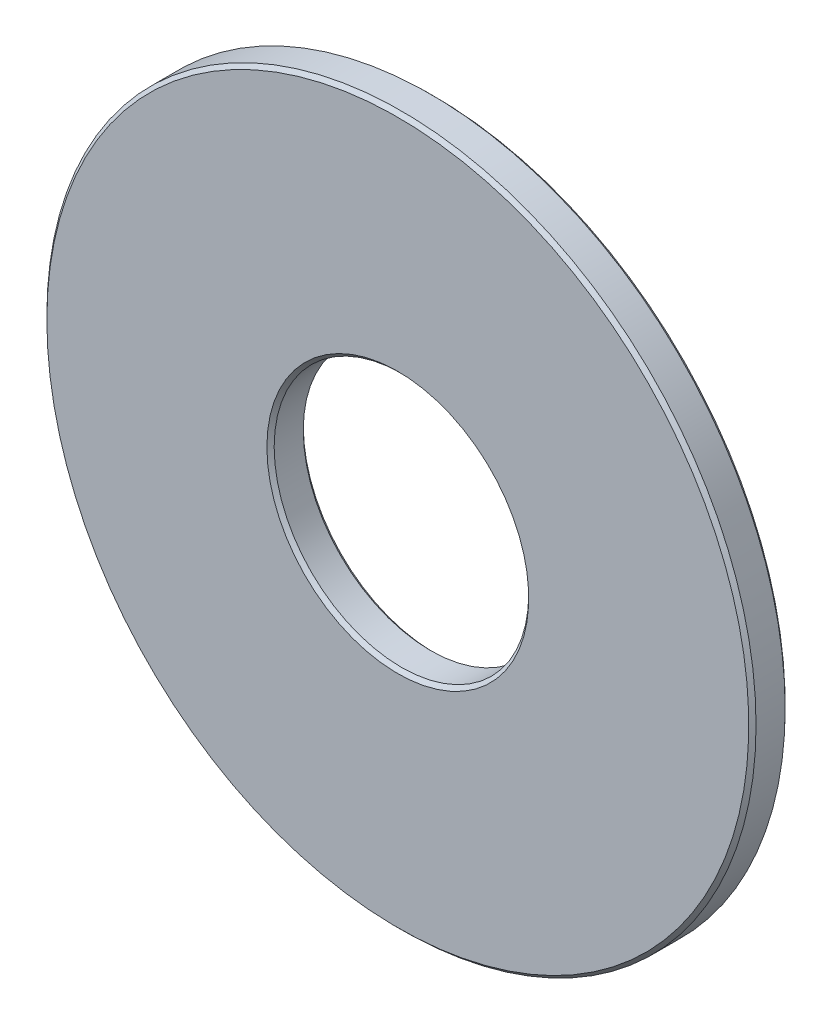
ISO-10303-21;
HEADER;
FILE_DESCRIPTION(('STEP AP214'),'2;1');
FILE_NAME('part.step','',(''),(''),'','','');
FILE_SCHEMA(('AUTOMOTIVE_DESIGN { 1 0 10303 214 1 1 1 1 }'));
ENDSEC;
DATA;
#1=APPLICATION_CONTEXT('core data for automotive mechanical design processes');
#2=APPLICATION_PROTOCOL_DEFINITION('international standard','automotive_design',2000,#1);
#3=PRODUCT_CONTEXT('',#1,'mechanical');
#4=PRODUCT('Part','Part','',(#3));
#5=PRODUCT_RELATED_PRODUCT_CATEGORY('part','',(#4));
#6=PRODUCT_DEFINITION_FORMATION('','',#4);
#7=PRODUCT_DEFINITION_CONTEXT('part definition',#1,'design');
#8=PRODUCT_DEFINITION('design','',#6,#7);
#9=PRODUCT_DEFINITION_SHAPE('','',#8);
#10=(LENGTH_UNIT() NAMED_UNIT(*) SI_UNIT(.MILLI.,.METRE.));
#11=(NAMED_UNIT(*) PLANE_ANGLE_UNIT() SI_UNIT($,.RADIAN.));
#12=(NAMED_UNIT(*) SI_UNIT($,.STERADIAN.) SOLID_ANGLE_UNIT());
#13=UNCERTAINTY_MEASURE_WITH_UNIT(LENGTH_MEASURE(1.E-05),#10,'distance_accuracy_value','');
#14=(GEOMETRIC_REPRESENTATION_CONTEXT(3) GLOBAL_UNCERTAINTY_ASSIGNED_CONTEXT((#13)) GLOBAL_UNIT_ASSIGNED_CONTEXT((#10,
#11,#12)) REPRESENTATION_CONTEXT('',''));
#15=CARTESIAN_POINT('',(0.,0.,0.));
#16=DIRECTION('',(0.,0.,1.));
#17=DIRECTION('',(1.,0.,0.));
#18=AXIS2_PLACEMENT_3D('',#15,#16,#17);
#19=CARTESIAN_POINT('',(0.,0.,2.));
#20=DIRECTION('',(0.,0.,-1.));
#21=DIRECTION('',(-1.,0.,0.));
#22=AXIS2_PLACEMENT_3D('',#19,#20,#21);
#23=CYLINDRICAL_SURFACE('',#22,7.);
#24=CARTESIAN_POINT('',(0.,0.,0.2));
#25=DIRECTION('',(0.,0.,-1.));
#26=DIRECTION('',(-1.,0.,0.));
#27=AXIS2_PLACEMENT_3D('',#24,#25,#26);
#28=CIRCLE('',#27,7.);
#29=CARTESIAN_POINT('',(-7.,0.,0.2));
#30=VERTEX_POINT('',#29);
#31=EDGE_CURVE('E25',#30,#30,#28,.T.);
#32=ORIENTED_EDGE('',*,*,#31,.T.);
#33=EDGE_LOOP('',(#32));
#34=FACE_BOUND('',#33,.T.);
#35=CARTESIAN_POINT('',(0.,0.,1.8));
#36=DIRECTION('',(0.,0.,-1.));
#37=DIRECTION('',(-1.,0.,0.));
#38=AXIS2_PLACEMENT_3D('',#35,#36,#37);
#39=CIRCLE('',#38,7.);
#40=CARTESIAN_POINT('',(-7.,0.,1.8));
#41=VERTEX_POINT('',#40);
#42=EDGE_CURVE('E29',#41,#41,#39,.F.);
#43=ORIENTED_EDGE('',*,*,#42,.T.);
#44=EDGE_LOOP('',(#43));
#45=FACE_BOUND('',#44,.T.);
#46=ADVANCED_FACE('F14',(#34,#45),#23,.F.);
#47=CARTESIAN_POINT('',(0.,0.,2.));
#48=DIRECTION('',(0.,0.,-1.));
#49=DIRECTION('',(-1.,0.,0.));
#50=AXIS2_PLACEMENT_3D('',#47,#48,#49);
#51=CYLINDRICAL_SURFACE('',#50,19.5);
#52=CARTESIAN_POINT('',(0.,0.,0.2));
#53=DIRECTION('',(0.,0.,-1.));
#54=DIRECTION('',(-1.,0.,0.));
#55=AXIS2_PLACEMENT_3D('',#52,#53,#54);
#56=CIRCLE('',#55,19.5);
#57=CARTESIAN_POINT('',(-19.5,0.,0.2));
#58=VERTEX_POINT('',#57);
#59=EDGE_CURVE('E34',#58,#58,#56,.F.);
#60=ORIENTED_EDGE('',*,*,#59,.T.);
#61=EDGE_LOOP('',(#60));
#62=FACE_BOUND('',#61,.T.);
#63=CARTESIAN_POINT('',(0.,0.,1.8));
#64=DIRECTION('',(0.,0.,-1.));
#65=DIRECTION('',(-1.,0.,0.));
#66=AXIS2_PLACEMENT_3D('',#63,#64,#65);
#67=CIRCLE('',#66,19.5);
#68=CARTESIAN_POINT('',(-19.5,0.,1.8));
#69=VERTEX_POINT('',#68);
#70=EDGE_CURVE('E37',#69,#69,#67,.T.);
#71=ORIENTED_EDGE('',*,*,#70,.T.);
#72=EDGE_LOOP('',(#71));
#73=FACE_BOUND('',#72,.T.);
#74=ADVANCED_FACE('F16',(#62,#73),#51,.T.);
#75=CARTESIAN_POINT('',(0.,0.,2.));
#76=DIRECTION('',(0.,0.,-1.));
#77=DIRECTION('',(-1.,0.,0.));
#78=AXIS2_PLACEMENT_3D('',#75,#76,#77);
#79=PLANE('',#78);
#80=CARTESIAN_POINT('',(0.,0.,2.));
#81=DIRECTION('',(0.,0.,-1.));
#82=DIRECTION('',(-1.,0.,0.));
#83=AXIS2_PLACEMENT_3D('',#80,#81,#82);
#84=CIRCLE('',#83,7.2);
#85=CARTESIAN_POINT('',(-7.2,0.,2.));
#86=VERTEX_POINT('',#85);
#87=EDGE_CURVE('E10',#86,#86,#84,.T.);
#88=ORIENTED_EDGE('',*,*,#87,.T.);
#89=EDGE_LOOP('',(#88));
#90=FACE_BOUND('',#89,.T.);
#91=CARTESIAN_POINT('',(0.,0.,2.));
#92=DIRECTION('',(0.,0.,-1.));
#93=DIRECTION('',(-1.,0.,0.));
#94=AXIS2_PLACEMENT_3D('',#91,#92,#93);
#95=CIRCLE('',#94,19.3);
#96=CARTESIAN_POINT('',(-19.3,0.,2.));
#97=VERTEX_POINT('',#96);
#98=EDGE_CURVE('E21',#97,#97,#95,.F.);
#99=ORIENTED_EDGE('',*,*,#98,.T.);
#100=EDGE_LOOP('',(#99));
#101=FACE_BOUND('',#100,.T.);
#102=ADVANCED_FACE('F77',(#90,#101),#79,.F.);
#103=CARTESIAN_POINT('',(0.,0.,0.));
#104=DIRECTION('',(0.,0.,-1.));
#105=DIRECTION('',(-1.,0.,0.));
#106=AXIS2_PLACEMENT_3D('',#103,#104,#105);
#107=PLANE('',#106);
#108=CARTESIAN_POINT('',(0.,0.,0.));
#109=DIRECTION('',(0.,0.,-1.));
#110=DIRECTION('',(-1.,0.,0.));
#111=AXIS2_PLACEMENT_3D('',#108,#109,#110);
#112=CIRCLE('',#111,19.3);
#113=CARTESIAN_POINT('',(-19.3,0.,0.));
#114=VERTEX_POINT('',#113);
#115=EDGE_CURVE('E40',#114,#114,#112,.T.);
#116=ORIENTED_EDGE('',*,*,#115,.T.);
#117=EDGE_LOOP('',(#116));
#118=FACE_BOUND('',#117,.T.);
#119=CARTESIAN_POINT('',(0.,0.,0.));
#120=DIRECTION('',(0.,0.,-1.));
#121=DIRECTION('',(-1.,0.,0.));
#122=AXIS2_PLACEMENT_3D('',#119,#120,#121);
#123=CIRCLE('',#122,7.2);
#124=CARTESIAN_POINT('',(-7.2,0.,0.));
#125=VERTEX_POINT('',#124);
#126=EDGE_CURVE('E43',#125,#125,#123,.F.);
#127=ORIENTED_EDGE('',*,*,#126,.T.);
#128=EDGE_LOOP('',(#127));
#129=FACE_BOUND('',#128,.T.);
#130=ADVANCED_FACE('F47',(#118,#129),#107,.T.);
#131=CARTESIAN_POINT('',(0.,0.,0.));
#132=DIRECTION('',(0.,0.,1.));
#133=DIRECTION('',(1.,0.,0.));
#134=AXIS2_PLACEMENT_3D('',#131,#132,#133);
#135=CONICAL_SURFACE('',#134,19.3,0.785398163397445);
#136=ORIENTED_EDGE('',*,*,#59,.F.);
#137=EDGE_LOOP('',(#136));
#138=FACE_BOUND('',#137,.T.);
#139=ORIENTED_EDGE('',*,*,#115,.F.);
#140=EDGE_LOOP('',(#139));
#141=FACE_BOUND('',#140,.T.);
#142=ADVANCED_FACE('F53',(#138,#141),#135,.T.);
#143=CARTESIAN_POINT('',(0.,0.,0.2));
#144=DIRECTION('',(0.,0.,-1.));
#145=DIRECTION('',(-1.,0.,0.));
#146=AXIS2_PLACEMENT_3D('',#143,#144,#145);
#147=CONICAL_SURFACE('',#146,7.,0.785398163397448);
#148=ORIENTED_EDGE('',*,*,#126,.F.);
#149=EDGE_LOOP('',(#148));
#150=FACE_BOUND('',#149,.T.);
#151=ORIENTED_EDGE('',*,*,#31,.F.);
#152=EDGE_LOOP('',(#151));
#153=FACE_BOUND('',#152,.T.);
#154=ADVANCED_FACE('F49',(#150,#153),#147,.F.);
#155=CARTESIAN_POINT('',(0.,0.,2.));
#156=DIRECTION('',(0.,0.,1.));
#157=DIRECTION('',(1.,0.,0.));
#158=AXIS2_PLACEMENT_3D('',#155,#156,#157);
#159=CONICAL_SURFACE('',#158,7.2,0.785398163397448);
#160=ORIENTED_EDGE('',*,*,#42,.F.);
#161=EDGE_LOOP('',(#160));
#162=FACE_BOUND('',#161,.T.);
#163=ORIENTED_EDGE('',*,*,#87,.F.);
#164=EDGE_LOOP('',(#163));
#165=FACE_BOUND('',#164,.T.);
#166=ADVANCED_FACE('F52',(#162,#165),#159,.F.);
#167=CARTESIAN_POINT('',(0.,0.,1.8));
#168=DIRECTION('',(0.,0.,-1.));
#169=DIRECTION('',(-1.,0.,0.));
#170=AXIS2_PLACEMENT_3D('',#167,#168,#169);
#171=CONICAL_SURFACE('',#170,19.5,0.785398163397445);
#172=ORIENTED_EDGE('',*,*,#98,.F.);
#173=EDGE_LOOP('',(#172));
#174=FACE_BOUND('',#173,.T.);
#175=ORIENTED_EDGE('',*,*,#70,.F.);
#176=EDGE_LOOP('',(#175));
#177=FACE_BOUND('',#176,.T.);
#178=ADVANCED_FACE('F63',(#174,#177),#171,.T.);
#179=CLOSED_SHELL('',(#46,#74,#102,#130,#142,#154,#166,#178));
#180=MANIFOLD_SOLID_BREP('B1',#179);
#181=ADVANCED_BREP_SHAPE_REPRESENTATION('',(#18,#180),#14);
#182=SHAPE_DEFINITION_REPRESENTATION(#9,#181);
ENDSEC;
END-ISO-10303-21;
